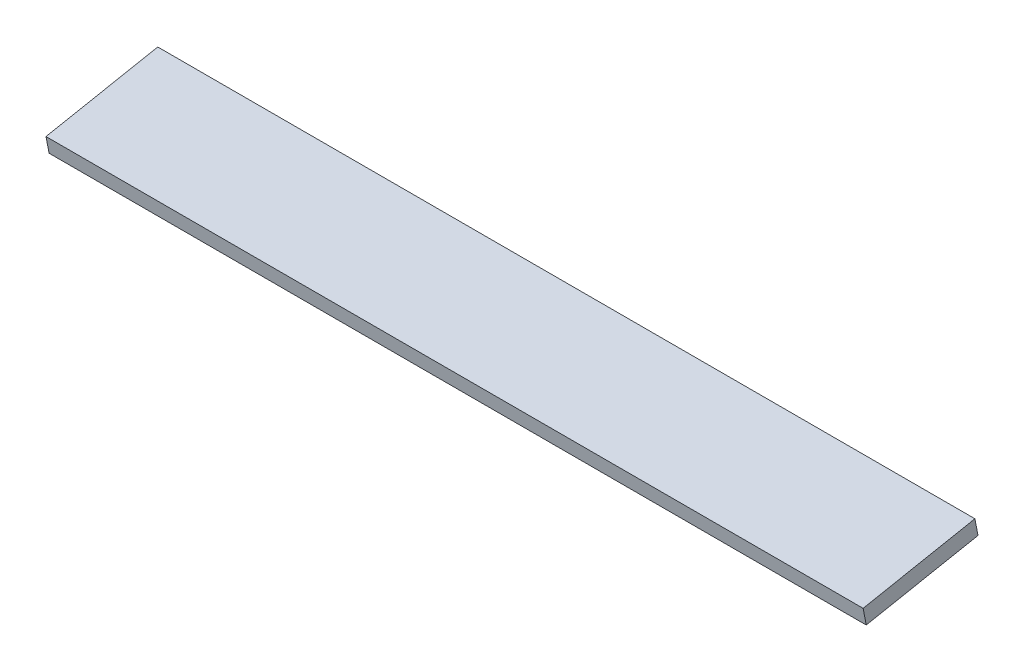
from build123d import *

# Parameters (mm, degrees)
SALIENTE_EXTRUIR2_DEPTH = 500


with BuildPart() as part:
    # Croquis3 → Saliente-Extruir2 (new body)
    with BuildSketch(Plane(origin=(-500, 0, 0), x_dir=(0, 0, -1), z_dir=(1, 0, 0))):
        Polygon((10, 494.152803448), (78.383825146, 507.426846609), (76.478284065, 517.24361355), (8.094458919, 503.96957039), align=None)
    extrude(amount=SALIENTE_EXTRUIR2_DEPTH)


solid = part.part
